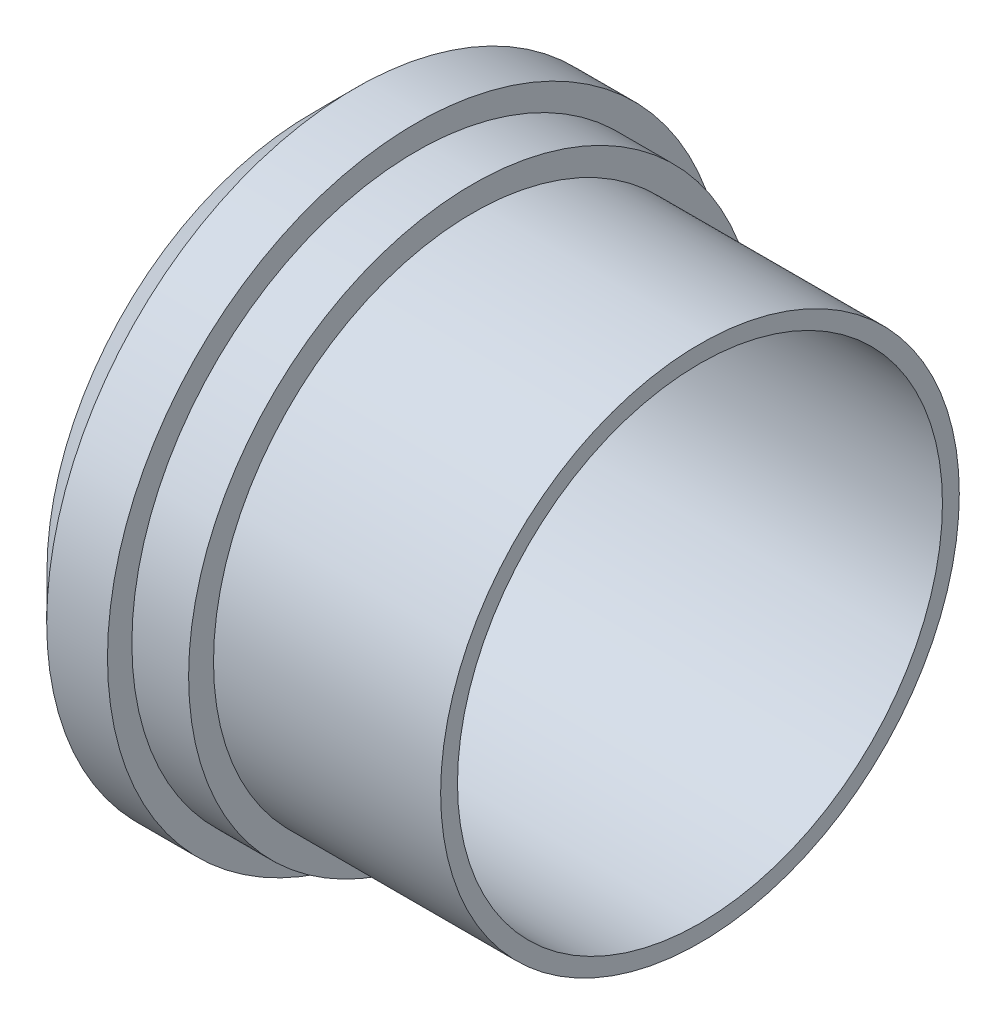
ISO-10303-21;
HEADER;
FILE_DESCRIPTION(('STEP AP214'),'2;1');
FILE_NAME('part.step','',(''),(''),'','','');
FILE_SCHEMA(('AUTOMOTIVE_DESIGN { 1 0 10303 214 1 1 1 1 }'));
ENDSEC;
DATA;
#1=APPLICATION_CONTEXT('core data for automotive mechanical design processes');
#2=APPLICATION_PROTOCOL_DEFINITION('international standard','automotive_design',2000,#1);
#3=PRODUCT_CONTEXT('',#1,'mechanical');
#4=PRODUCT('Part','Part','',(#3));
#5=PRODUCT_RELATED_PRODUCT_CATEGORY('part','',(#4));
#6=PRODUCT_DEFINITION_FORMATION('','',#4);
#7=PRODUCT_DEFINITION_CONTEXT('part definition',#1,'design');
#8=PRODUCT_DEFINITION('design','',#6,#7);
#9=PRODUCT_DEFINITION_SHAPE('','',#8);
#10=(LENGTH_UNIT() NAMED_UNIT(*) SI_UNIT(.MILLI.,.METRE.));
#11=(NAMED_UNIT(*) PLANE_ANGLE_UNIT() SI_UNIT($,.RADIAN.));
#12=(NAMED_UNIT(*) SI_UNIT($,.STERADIAN.) SOLID_ANGLE_UNIT());
#13=UNCERTAINTY_MEASURE_WITH_UNIT(LENGTH_MEASURE(1.E-05),#10,'distance_accuracy_value','');
#14=(GEOMETRIC_REPRESENTATION_CONTEXT(3) GLOBAL_UNCERTAINTY_ASSIGNED_CONTEXT((#13)) GLOBAL_UNIT_ASSIGNED_CONTEXT((#10,
#11,#12)) REPRESENTATION_CONTEXT('',''));
#15=CARTESIAN_POINT('',(0.,0.,0.));
#16=DIRECTION('',(0.,0.,1.));
#17=DIRECTION('',(1.,0.,0.));
#18=AXIS2_PLACEMENT_3D('',#15,#16,#17);
#19=CARTESIAN_POINT('',(0.,25.4,0.));
#20=DIRECTION('',(1.,0.,0.));
#21=DIRECTION('',(0.,0.,-1.));
#22=AXIS2_PLACEMENT_3D('',#19,#20,#21);
#23=PLANE('',#22);
#24=CARTESIAN_POINT('',(0.,25.4,0.));
#25=DIRECTION('',(-1.,0.,0.));
#26=DIRECTION('',(0.,0.,1.));
#27=AXIS2_PLACEMENT_3D('',#24,#25,#26);
#28=CIRCLE('',#27,23.749);
#29=CARTESIAN_POINT('',(0.,25.4,23.749));
#30=VERTEX_POINT('',#29);
#31=EDGE_CURVE('E59',#30,#30,#28,.T.);
#32=ORIENTED_EDGE('',*,*,#31,.T.);
#33=EDGE_LOOP('',(#32));
#34=FACE_BOUND('',#33,.T.);
#35=CARTESIAN_POINT('',(0.,25.4,0.));
#36=DIRECTION('',(-1.,0.,0.));
#37=DIRECTION('',(0.,0.,1.));
#38=AXIS2_PLACEMENT_3D('',#35,#36,#37);
#39=CIRCLE('',#38,25.4);
#40=CARTESIAN_POINT('',(0.,25.4,25.4));
#41=VERTEX_POINT('',#40);
#42=EDGE_CURVE('E10',#41,#41,#39,.T.);
#43=ORIENTED_EDGE('',*,*,#42,.F.);
#44=EDGE_LOOP('',(#43));
#45=FACE_BOUND('',#44,.T.);
#46=ADVANCED_FACE('F31',(#34,#45),#23,.T.);
#47=CARTESIAN_POINT('',(-38.1,25.4,0.));
#48=DIRECTION('',(-1.,0.,0.));
#49=DIRECTION('',(0.,0.,1.));
#50=AXIS2_PLACEMENT_3D('',#47,#48,#49);
#51=CYLINDRICAL_SURFACE('',#50,25.4);
#52=ORIENTED_EDGE('',*,*,#42,.T.);
#53=EDGE_LOOP('',(#52));
#54=FACE_BOUND('',#53,.T.);
#55=CARTESIAN_POINT('',(-22.24532,25.4,0.));
#56=DIRECTION('',(-1.,0.,0.));
#57=DIRECTION('',(0.,0.,1.));
#58=AXIS2_PLACEMENT_3D('',#55,#56,#57);
#59=CIRCLE('',#58,25.4);
#60=CARTESIAN_POINT('',(-22.24532,25.4,25.4));
#61=VERTEX_POINT('',#60);
#62=EDGE_CURVE('E37',#61,#61,#59,.T.);
#63=ORIENTED_EDGE('',*,*,#62,.F.);
#64=EDGE_LOOP('',(#63));
#65=FACE_BOUND('',#64,.T.);
#66=ADVANCED_FACE('F92',(#54,#65),#51,.T.);
#67=CARTESIAN_POINT('',(-22.24532,0.,0.));
#68=DIRECTION('',(1.,0.,0.));
#69=DIRECTION('',(0.,0.,-1.));
#70=AXIS2_PLACEMENT_3D('',#67,#68,#69);
#71=PLANE('',#70);
#72=ORIENTED_EDGE('',*,*,#62,.T.);
#73=EDGE_LOOP('',(#72));
#74=FACE_BOUND('',#73,.T.);
#75=CARTESIAN_POINT('',(-22.24532,25.4,0.));
#76=DIRECTION('',(-1.,0.,0.));
#77=DIRECTION('',(0.,0.,1.));
#78=AXIS2_PLACEMENT_3D('',#75,#76,#77);
#79=CIRCLE('',#78,27.8384);
#80=CARTESIAN_POINT('',(-22.24532,25.4,27.8384));
#81=VERTEX_POINT('',#80);
#82=EDGE_CURVE('E41',#81,#81,#79,.T.);
#83=ORIENTED_EDGE('',*,*,#82,.F.);
#84=EDGE_LOOP('',(#83));
#85=FACE_BOUND('',#84,.T.);
#86=ADVANCED_FACE('F96',(#74,#85),#71,.T.);
#87=CARTESIAN_POINT('',(-38.1,25.4,0.));
#88=DIRECTION('',(-1.,0.,0.));
#89=DIRECTION('',(0.,0.,1.));
#90=AXIS2_PLACEMENT_3D('',#87,#88,#89);
#91=CYLINDRICAL_SURFACE('',#90,27.8384);
#92=ORIENTED_EDGE('',*,*,#82,.T.);
#93=EDGE_LOOP('',(#92));
#94=FACE_BOUND('',#93,.T.);
#95=CARTESIAN_POINT('',(-27.80284,25.4,0.));
#96=DIRECTION('',(-1.,0.,0.));
#97=DIRECTION('',(0.,0.,1.));
#98=AXIS2_PLACEMENT_3D('',#95,#96,#97);
#99=CIRCLE('',#98,27.8384);
#100=CARTESIAN_POINT('',(-27.80284,25.4,27.8384));
#101=VERTEX_POINT('',#100);
#102=EDGE_CURVE('E45',#101,#101,#99,.T.);
#103=ORIENTED_EDGE('',*,*,#102,.F.);
#104=EDGE_LOOP('',(#103));
#105=FACE_BOUND('',#104,.T.);
#106=ADVANCED_FACE('F100',(#94,#105),#91,.T.);
#107=CARTESIAN_POINT('',(-27.80284,-2.43840000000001,0.));
#108=DIRECTION('',(1.,0.,0.));
#109=DIRECTION('',(0.,0.,-1.));
#110=AXIS2_PLACEMENT_3D('',#107,#108,#109);
#111=PLANE('',#110);
#112=ORIENTED_EDGE('',*,*,#102,.T.);
#113=EDGE_LOOP('',(#112));
#114=FACE_BOUND('',#113,.T.);
#115=CARTESIAN_POINT('',(-27.80284,25.4,0.));
#116=DIRECTION('',(-1.,0.,0.));
#117=DIRECTION('',(0.,0.,1.));
#118=AXIS2_PLACEMENT_3D('',#115,#116,#117);
#119=CIRCLE('',#118,30.226);
#120=CARTESIAN_POINT('',(-27.80284,25.4,30.226));
#121=VERTEX_POINT('',#120);
#122=EDGE_CURVE('E50',#121,#121,#119,.T.);
#123=ORIENTED_EDGE('',*,*,#122,.F.);
#124=EDGE_LOOP('',(#123));
#125=FACE_BOUND('',#124,.T.);
#126=ADVANCED_FACE('F88',(#114,#125),#111,.T.);
#127=CARTESIAN_POINT('',(-38.1,25.4,0.));
#128=DIRECTION('',(-1.,0.,0.));
#129=DIRECTION('',(0.,0.,1.));
#130=AXIS2_PLACEMENT_3D('',#127,#128,#129);
#131=CYLINDRICAL_SURFACE('',#130,30.226);
#132=ORIENTED_EDGE('',*,*,#122,.T.);
#133=EDGE_LOOP('',(#132));
#134=FACE_BOUND('',#133,.T.);
#135=CARTESIAN_POINT('',(-33.7566,25.4,0.));
#136=DIRECTION('',(-1.,0.,0.));
#137=DIRECTION('',(0.,0.,1.));
#138=AXIS2_PLACEMENT_3D('',#135,#136,#137);
#139=CIRCLE('',#138,30.226);
#140=CARTESIAN_POINT('',(-33.7566,25.4,30.226));
#141=VERTEX_POINT('',#140);
#142=EDGE_CURVE('E53',#141,#141,#139,.T.);
#143=ORIENTED_EDGE('',*,*,#142,.F.);
#144=EDGE_LOOP('',(#143));
#145=FACE_BOUND('',#144,.T.);
#146=ADVANCED_FACE('F82',(#134,#145),#131,.T.);
#147=CARTESIAN_POINT('',(-38.1,25.4,0.));
#148=DIRECTION('',(1.,0.,0.));
#149=DIRECTION('',(0.,0.,-1.));
#150=AXIS2_PLACEMENT_3D('',#147,#148,#149);
#151=CONICAL_SURFACE('',#150,25.8572,0.788313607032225);
#152=ORIENTED_EDGE('',*,*,#142,.T.);
#153=EDGE_LOOP('',(#152));
#154=FACE_BOUND('',#153,.T.);
#155=CARTESIAN_POINT('',(-38.1,25.4,0.));
#156=DIRECTION('',(-1.,0.,0.));
#157=DIRECTION('',(0.,0.,1.));
#158=AXIS2_PLACEMENT_3D('',#155,#156,#157);
#159=CIRCLE('',#158,25.8572);
#160=CARTESIAN_POINT('',(-38.1,25.4,25.8572));
#161=VERTEX_POINT('',#160);
#162=EDGE_CURVE('E56',#161,#161,#159,.T.);
#163=ORIENTED_EDGE('',*,*,#162,.F.);
#164=EDGE_LOOP('',(#163));
#165=FACE_BOUND('',#164,.T.);
#166=ADVANCED_FACE('F77',(#154,#165),#151,.T.);
#167=CARTESIAN_POINT('',(-38.1,-0.457200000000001,0.));
#168=DIRECTION('',(-1.,0.,0.));
#169=DIRECTION('',(0.,0.,1.));
#170=AXIS2_PLACEMENT_3D('',#167,#168,#169);
#171=PLANE('',#170);
#172=CARTESIAN_POINT('',(-38.1,25.4,0.));
#173=DIRECTION('',(-1.,0.,0.));
#174=DIRECTION('',(0.,0.,1.));
#175=AXIS2_PLACEMENT_3D('',#172,#173,#174);
#176=CIRCLE('',#175,23.749);
#177=CARTESIAN_POINT('',(-38.1,25.4,23.749));
#178=VERTEX_POINT('',#177);
#179=EDGE_CURVE('E60',#178,#178,#176,.T.);
#180=ORIENTED_EDGE('',*,*,#179,.F.);
#181=EDGE_LOOP('',(#180));
#182=FACE_BOUND('',#181,.T.);
#183=ORIENTED_EDGE('',*,*,#162,.T.);
#184=EDGE_LOOP('',(#183));
#185=FACE_BOUND('',#184,.T.);
#186=ADVANCED_FACE('F71',(#182,#185),#171,.T.);
#187=CARTESIAN_POINT('',(0.,25.4,0.));
#188=DIRECTION('',(-1.,0.,0.));
#189=DIRECTION('',(0.,0.,1.));
#190=AXIS2_PLACEMENT_3D('',#187,#188,#189);
#191=CYLINDRICAL_SURFACE('',#190,23.749);
#192=CARTESIAN_POINT('',(0.,25.4,23.749));
#193=CARTESIAN_POINT('',(-0.396875,25.4,23.749));
#194=CARTESIAN_POINT('',(-0.79375,25.4,23.749));
#195=CARTESIAN_POINT('',(-1.5875,25.4,23.749));
#196=CARTESIAN_POINT('',(-1.984375,25.4,23.749));
#197=CARTESIAN_POINT('',(-2.778125,25.4,23.749));
#198=CARTESIAN_POINT('',(-3.175,25.4,23.749));
#199=CARTESIAN_POINT('',(-3.96875,25.4,23.749));
#200=CARTESIAN_POINT('',(-4.365625,25.4,23.749));
#201=CARTESIAN_POINT('',(-5.159375,25.4,23.749));
#202=CARTESIAN_POINT('',(-5.55625,25.4,23.749));
#203=CARTESIAN_POINT('',(-6.35,25.4,23.749));
#204=CARTESIAN_POINT('',(-6.746875,25.4,23.749));
#205=CARTESIAN_POINT('',(-7.540625,25.4,23.749));
#206=CARTESIAN_POINT('',(-7.9375,25.4,23.749));
#207=CARTESIAN_POINT('',(-8.73125,25.4,23.749));
#208=CARTESIAN_POINT('',(-9.128125,25.4,23.749));
#209=CARTESIAN_POINT('',(-9.921875,25.4,23.749));
#210=CARTESIAN_POINT('',(-10.31875,25.4,23.749));
#211=CARTESIAN_POINT('',(-11.1125,25.4,23.749));
#212=CARTESIAN_POINT('',(-11.509375,25.4,23.749));
#213=CARTESIAN_POINT('',(-12.303125,25.4,23.749));
#214=CARTESIAN_POINT('',(-12.7,25.4,23.749));
#215=CARTESIAN_POINT('',(-13.49375,25.4,23.749));
#216=CARTESIAN_POINT('',(-13.890625,25.4,23.749));
#217=CARTESIAN_POINT('',(-14.684375,25.4,23.749));
#218=CARTESIAN_POINT('',(-15.08125,25.4,23.749));
#219=CARTESIAN_POINT('',(-15.875,25.4,23.749));
#220=CARTESIAN_POINT('',(-16.271875,25.4,23.749));
#221=CARTESIAN_POINT('',(-17.065625,25.4,23.749));
#222=CARTESIAN_POINT('',(-17.4625,25.4,23.749));
#223=CARTESIAN_POINT('',(-18.25625,25.4,23.749));
#224=CARTESIAN_POINT('',(-18.653125,25.4,23.749));
#225=CARTESIAN_POINT('',(-19.446875,25.4,23.749));
#226=CARTESIAN_POINT('',(-19.84375,25.4,23.749));
#227=CARTESIAN_POINT('',(-20.6375,25.4,23.749));
#228=CARTESIAN_POINT('',(-21.034375,25.4,23.749));
#229=CARTESIAN_POINT('',(-21.828125,25.4,23.749));
#230=CARTESIAN_POINT('',(-22.225,25.4,23.749));
#231=CARTESIAN_POINT('',(-23.01875,25.4,23.749));
#232=CARTESIAN_POINT('',(-23.415625,25.4,23.749));
#233=CARTESIAN_POINT('',(-24.209375,25.4,23.749));
#234=CARTESIAN_POINT('',(-24.60625,25.4,23.749));
#235=CARTESIAN_POINT('',(-25.4,25.4,23.749));
#236=CARTESIAN_POINT('',(-25.796875,25.4,23.749));
#237=CARTESIAN_POINT('',(-26.590625,25.4,23.749));
#238=CARTESIAN_POINT('',(-26.9875,25.4,23.749));
#239=CARTESIAN_POINT('',(-27.78125,25.4,23.749));
#240=CARTESIAN_POINT('',(-28.178125,25.4,23.749));
#241=CARTESIAN_POINT('',(-28.971875,25.4,23.749));
#242=CARTESIAN_POINT('',(-29.36875,25.4,23.749));
#243=CARTESIAN_POINT('',(-30.1625,25.4,23.749));
#244=CARTESIAN_POINT('',(-30.559375,25.4,23.749));
#245=CARTESIAN_POINT('',(-31.353125,25.4,23.749));
#246=CARTESIAN_POINT('',(-31.75,25.4,23.749));
#247=CARTESIAN_POINT('',(-32.54375,25.4,23.749));
#248=CARTESIAN_POINT('',(-32.940625,25.4,23.749));
#249=CARTESIAN_POINT('',(-33.734375,25.4,23.749));
#250=CARTESIAN_POINT('',(-34.13125,25.4,23.749));
#251=CARTESIAN_POINT('',(-34.925,25.4,23.749));
#252=CARTESIAN_POINT('',(-35.321875,25.4,23.749));
#253=CARTESIAN_POINT('',(-36.115625,25.4,23.749));
#254=CARTESIAN_POINT('',(-36.5125,25.4,23.749));
#255=CARTESIAN_POINT('',(-37.30625,25.4,23.749));
#256=CARTESIAN_POINT('',(-37.703125,25.4,23.749));
#257=CARTESIAN_POINT('',(-38.1,25.4,23.749));
#258=B_SPLINE_CURVE_WITH_KNOTS('',3,(#192,#193,#194,#195,#196,#197,#198,#199,#200,#201,#202,
#203,#204,#205,#206,#207,#208,#209,#210,#211,#212,#213,#214,#215,#216,#217,#218,#219,#220,#221,
#222,#223,#224,#225,#226,#227,#228,#229,#230,#231,#232,#233,#234,#235,#236,#237,#238,#239,#240,
#241,#242,#243,#244,#245,#246,#247,#248,#249,#250,#251,#252,#253,#254,#255,#256,#257),
.UNSPECIFIED.,.F.,.F.,(4,2,2,2,2,2,2,2,2,2,2,2,2,2,2,2,2,2,2,2,2,2,2,2,2,2,2,2,2,2,2,2,4),(0.,
1.190625,2.38125,3.571875,4.7625,5.953125,7.14375,8.334375,9.525,10.715625,11.90625,13.096875,
14.2875,15.478125,16.66875,17.859375,19.05,20.240625,21.43125,22.621875,23.8125,25.003125,
26.19375,27.384375,28.575,29.765625,30.95625,32.146875,33.3375,34.528125,35.71875,36.909375,
38.1),.UNSPECIFIED.);
#259=EDGE_CURVE('BSEAM68',#30,#178,#258,.T.);
#260=ORIENTED_EDGE('',*,*,#31,.F.);
#261=ORIENTED_EDGE('',*,*,#179,.T.);
#262=ORIENTED_EDGE('',*,*,#259,.T.);
#263=ORIENTED_EDGE('',*,*,#259,.F.);
#264=EDGE_LOOP('',(#260,#262,#261,#263));
#265=FACE_BOUND('',#264,.T.);
#266=ADVANCED_FACE('F68',(#265),#191,.F.);
#267=CLOSED_SHELL('',(#46,#66,#86,#106,#126,#146,#166,#186,#266));
#268=MANIFOLD_SOLID_BREP('B2',#267);
#269=ADVANCED_BREP_SHAPE_REPRESENTATION('',(#18,#268),#14);
#270=SHAPE_DEFINITION_REPRESENTATION(#9,#269);
ENDSEC;
END-ISO-10303-21;
